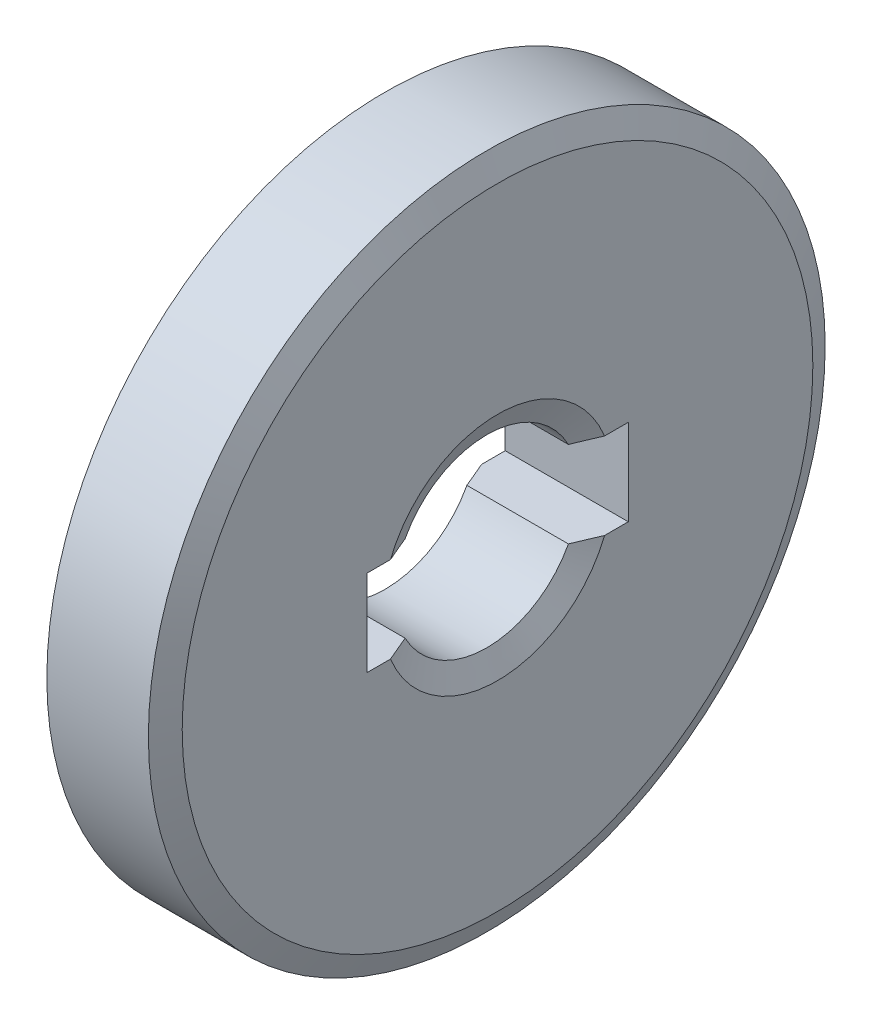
ISO-10303-21;
HEADER;
FILE_DESCRIPTION(('STEP AP214'),'2;1');
FILE_NAME('part.step','',(''),(''),'','','');
FILE_SCHEMA(('AUTOMOTIVE_DESIGN { 1 0 10303 214 1 1 1 1 }'));
ENDSEC;
DATA;
#1=APPLICATION_CONTEXT('core data for automotive mechanical design processes');
#2=APPLICATION_PROTOCOL_DEFINITION('international standard','automotive_design',2000,#1);
#3=PRODUCT_CONTEXT('',#1,'mechanical');
#4=PRODUCT('Part','Part','',(#3));
#5=PRODUCT_RELATED_PRODUCT_CATEGORY('part','',(#4));
#6=PRODUCT_DEFINITION_FORMATION('','',#4);
#7=PRODUCT_DEFINITION_CONTEXT('part definition',#1,'design');
#8=PRODUCT_DEFINITION('design','',#6,#7);
#9=PRODUCT_DEFINITION_SHAPE('','',#8);
#10=(LENGTH_UNIT() NAMED_UNIT(*) SI_UNIT(.MILLI.,.METRE.));
#11=(NAMED_UNIT(*) PLANE_ANGLE_UNIT() SI_UNIT($,.RADIAN.));
#12=(NAMED_UNIT(*) SI_UNIT($,.STERADIAN.) SOLID_ANGLE_UNIT());
#13=UNCERTAINTY_MEASURE_WITH_UNIT(LENGTH_MEASURE(1.E-05),#10,'distance_accuracy_value','');
#14=(GEOMETRIC_REPRESENTATION_CONTEXT(3) GLOBAL_UNCERTAINTY_ASSIGNED_CONTEXT((#13)) GLOBAL_UNIT_ASSIGNED_CONTEXT((#10,
#11,#12)) REPRESENTATION_CONTEXT('',''));
#15=CARTESIAN_POINT('',(0.,0.,0.));
#16=DIRECTION('',(0.,0.,1.));
#17=DIRECTION('',(1.,0.,0.));
#18=AXIS2_PLACEMENT_3D('',#15,#16,#17);
#19=CARTESIAN_POINT('',(16.2376909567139,0.,0.));
#20=DIRECTION('',(1.,0.,0.));
#21=DIRECTION('',(0.,0.,-1.));
#22=AXIS2_PLACEMENT_3D('',#19,#20,#21);
#23=CYLINDRICAL_SURFACE('',#22,3.);
#24=DIRECTION('',(1.,0.,0.));
#25=VECTOR('',#24,1.);
#26=CARTESIAN_POINT('',(16.2376909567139,1.4,2.65329983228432));
#27=LINE('',#26,#25);
#28=CARTESIAN_POINT('',(0.349730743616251,1.4,2.65329983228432));
#29=VERTEX_POINT('',#28);
#30=CARTESIAN_POINT('',(3.65026925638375,1.4,2.65329983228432));
#31=VERTEX_POINT('',#30);
#32=EDGE_CURVE('E303',#29,#31,#27,.T.);
#33=ORIENTED_EDGE('',*,*,#32,.F.);
#34=CARTESIAN_POINT('',(0.349730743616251,0.,0.));
#35=DIRECTION('',(-1.,0.,0.));
#36=DIRECTION('',(0.,0.,1.));
#37=AXIS2_PLACEMENT_3D('',#34,#35,#36);
#38=CIRCLE('',#37,3.);
#39=CARTESIAN_POINT('',(0.349730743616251,1.4,-2.65329983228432));
#40=VERTEX_POINT('',#39);
#41=EDGE_CURVE('E257',#29,#40,#38,.T.);
#42=ORIENTED_EDGE('',*,*,#41,.T.);
#43=DIRECTION('',(1.,0.,0.));
#44=VECTOR('',#43,1.);
#45=CARTESIAN_POINT('',(16.2376909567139,1.4,-2.65329983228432));
#46=LINE('',#45,#44);
#47=CARTESIAN_POINT('',(3.65026925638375,1.4,-2.65329983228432));
#48=VERTEX_POINT('',#47);
#49=EDGE_CURVE('E289',#48,#40,#46,.F.);
#50=ORIENTED_EDGE('',*,*,#49,.F.);
#51=CARTESIAN_POINT('',(3.65026925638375,0.,0.));
#52=DIRECTION('',(1.,0.,0.));
#53=DIRECTION('',(0.,0.,-1.));
#54=AXIS2_PLACEMENT_3D('',#51,#52,#53);
#55=CIRCLE('',#54,3.);
#56=EDGE_CURVE('E258',#48,#31,#55,.T.);
#57=ORIENTED_EDGE('',*,*,#56,.T.);
#58=EDGE_LOOP('',(#33,#42,#50,#57));
#59=FACE_BOUND('',#58,.T.);
#60=ADVANCED_FACE('F29',(#59),#23,.F.);
#61=CARTESIAN_POINT('',(0.,0.,0.));
#62=DIRECTION('',(-1.,0.,0.));
#63=DIRECTION('',(0.,0.,1.));
#64=AXIS2_PLACEMENT_3D('',#61,#62,#63);
#65=CONICAL_SURFACE('',#64,3.75000000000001,1.13446401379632);
#66=CARTESIAN_POINT('',(0.977240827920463,1.4,-0.881311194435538));
#67=CARTESIAN_POINT('',(0.959661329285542,1.4,-0.951983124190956));
#68=CARTESIAN_POINT('',(0.940704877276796,1.4,-1.02229247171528));
#69=CARTESIAN_POINT('',(0.900572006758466,1.4,-1.16224903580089));
#70=CARTESIAN_POINT('',(0.879396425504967,1.4,-1.23189649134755));
#71=CARTESIAN_POINT('',(0.835366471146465,1.4,-1.37057839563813));
#72=CARTESIAN_POINT('',(0.812513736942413,1.4,-1.4396133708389));
#73=CARTESIAN_POINT('',(0.765476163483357,1.4,-1.57723457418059));
#74=CARTESIAN_POINT('',(0.741291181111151,1.4,-1.64582075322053));
#75=CARTESIAN_POINT('',(0.667265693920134,1.4,-1.85080592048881));
#76=CARTESIAN_POINT('',(0.615884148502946,1.4,-1.98664686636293));
#77=CARTESIAN_POINT('',(0.510514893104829,1.4,-2.257339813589));
#78=CARTESIAN_POINT('',(0.45652655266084,1.4,-2.39219156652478));
#79=CARTESIAN_POINT('',(0.377029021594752,1.4,-2.58708791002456));
#80=CARTESIAN_POINT('',(0.352215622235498,1.4,-2.64741752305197));
#81=CARTESIAN_POINT('',(0.302290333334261,1.4,-2.76794800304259));
#82=CARTESIAN_POINT('',(0.277178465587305,1.4,-2.82814887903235));
#83=CARTESIAN_POINT('',(0.201443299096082,1.4,-3.00863906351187));
#84=CARTESIAN_POINT('',(0.150439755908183,1.4,-3.12876877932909));
#85=CARTESIAN_POINT('',(0.0381271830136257,1.4,-3.39103621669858));
#86=CARTESIAN_POINT('',(-0.023333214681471,1.4,-3.53310897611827));
#87=CARTESIAN_POINT('',(-0.147010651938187,1.4,-3.81692508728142));
#88=CARTESIAN_POINT('',(-0.209227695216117,1.4,-3.95866843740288));
#89=CARTESIAN_POINT('',(-0.396712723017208,1.4,-4.38353621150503));
#90=CARTESIAN_POINT('',(-0.5228124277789,1.4,-4.66629331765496));
#91=CARTESIAN_POINT('',(-0.77608459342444,1.4,-5.23074562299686));
#92=CARTESIAN_POINT('',(-0.903254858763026,1.4,-5.51244181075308));
#93=CARTESIAN_POINT('',(-1.1584550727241,1.4,-6.07542317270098));
#94=CARTESIAN_POINT('',(-1.28648496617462,1.4,-6.35670837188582));
#95=CARTESIAN_POINT('',(-1.41474041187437,1.4,-6.6378896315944));
#96=B_SPLINE_CURVE_WITH_KNOTS('',3,(#66,#67,#68,#69,#70,#71,#72,#73,#74,#75,#76,#77,#78,#79,#80,
#81,#82,#83,#84,#85,#86,#87,#88,#89,#90,#91,#92,#93,#94,#95),.UNSPECIFIED.,.F.,.F.,(4,2,2,2,2,2,
2,2,2,2,2,2,2,2,4),(0.,0.218434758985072,0.436787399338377,0.654929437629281,0.87309495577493,
1.30874660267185,1.74450414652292,1.94020300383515,2.13588765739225,2.52740981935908,
2.99179726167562,3.45618698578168,4.38498290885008,5.31219528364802,6.23934870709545),.UNSPECIFIED.);
#97=CARTESIAN_POINT('',(0.,1.4,-3.4788647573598));
#98=VERTEX_POINT('',#97);
#99=EDGE_CURVE('E284',#40,#98,#96,.T.);
#100=ORIENTED_EDGE('',*,*,#99,.F.);
#101=ORIENTED_EDGE('',*,*,#41,.F.);
#102=CARTESIAN_POINT('',(-0.745157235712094,1.4,5.16149676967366));
#103=CARTESIAN_POINT('',(-0.694484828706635,1.4,5.04889928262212));
#104=CARTESIAN_POINT('',(-0.643903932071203,1.4,4.93626053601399));
#105=CARTESIAN_POINT('',(-0.542971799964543,1.4,4.71087961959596));
#106=CARTESIAN_POINT('',(-0.492620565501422,1.4,4.59813744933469));
#107=CARTESIAN_POINT('',(-0.341999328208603,1.4,4.25976489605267));
#108=CARTESIAN_POINT('',(-0.242144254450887,1.4,4.03394958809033));
#109=CARTESIAN_POINT('',(-0.0444075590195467,1.4,3.58217214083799));
#110=CARTESIAN_POINT('',(0.0534786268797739,1.4,3.35621200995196));
#111=CARTESIAN_POINT('',(0.198150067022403,1.4,3.01631638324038));
#112=CARTESIAN_POINT('',(0.246020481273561,1.4,2.90284340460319));
#113=CARTESIAN_POINT('',(0.340774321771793,1.4,2.6754853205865));
#114=CARTESIAN_POINT('',(0.387657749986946,1.4,2.56160021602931));
#115=CARTESIAN_POINT('',(0.493766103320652,1.4,2.29946268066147));
#116=CARTESIAN_POINT('',(0.552532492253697,1.4,2.15102400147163));
#117=CARTESIAN_POINT('',(0.666485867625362,1.4,1.85286247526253));
#118=CARTESIAN_POINT('',(0.721675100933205,1.4,1.70314050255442));
#119=CARTESIAN_POINT('',(0.800034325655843,1.4,1.47681418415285));
#120=CARTESIAN_POINT('',(0.825444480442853,1.4,1.40098939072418));
#121=CARTESIAN_POINT('',(0.874253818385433,1.4,1.24871081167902));
#122=CARTESIAN_POINT('',(0.897653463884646,1.4,1.17225717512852));
#123=CARTESIAN_POINT('',(0.941861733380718,1.4,1.018420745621));
#124=CARTESIAN_POINT('',(0.962664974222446,1.4,0.941036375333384));
#125=CARTESIAN_POINT('',(1.00075252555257,1.4,0.785346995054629));
#126=CARTESIAN_POINT('',(1.01803397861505,1.4,0.707041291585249));
#127=CARTESIAN_POINT('',(1.03310060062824,1.4,0.628264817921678));
#128=B_SPLINE_CURVE_WITH_KNOTS('',3,(#102,#103,#104,#105,#106,#107,#108,#109,#110,#111,#112,
#113,#114,#115,#116,#117,#118,#119,#120,#121,#122,#123,#124,#125,#126,#127),.UNSPECIFIED.,.F.,
.F.,(4,2,2,2,2,2,2,2,2,2,2,2,4),(0.,0.370422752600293,0.740847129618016,1.48156792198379,
2.22030740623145,2.58977571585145,2.95924328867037,3.43816621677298,3.91678535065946,
4.15667188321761,4.39650310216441,4.63682358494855,4.87733828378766),.UNSPECIFIED.);
#129=CARTESIAN_POINT('',(0.,1.4,3.4788647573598));
#130=VERTEX_POINT('',#129);
#131=EDGE_CURVE('E298',#130,#29,#128,.T.);
#132=ORIENTED_EDGE('',*,*,#131,.F.);
#133=CARTESIAN_POINT('',(0.,0.,0.));
#134=DIRECTION('',(-1.,0.,0.));
#135=DIRECTION('',(0.,0.,1.));
#136=AXIS2_PLACEMENT_3D('',#133,#134,#135);
#137=CIRCLE('',#136,3.75000000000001);
#138=EDGE_CURVE('E277',#98,#130,#137,.F.);
#139=ORIENTED_EDGE('',*,*,#138,.F.);
#140=EDGE_LOOP('',(#100,#101,#132,#139));
#141=FACE_BOUND('',#140,.T.);
#142=ADVANCED_FACE('F227',(#141),#65,.F.);
#143=CARTESIAN_POINT('',(3.65026925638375,0.,0.));
#144=DIRECTION('',(1.,0.,0.));
#145=DIRECTION('',(0.,0.,-1.));
#146=AXIS2_PLACEMENT_3D('',#143,#144,#145);
#147=CONICAL_SURFACE('',#146,3.,1.13446401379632);
#148=CARTESIAN_POINT('',(5.41474041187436,1.4,-6.6378896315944));
#149=CARTESIAN_POINT('',(5.28628091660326,1.4,-6.35625145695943));
#150=CARTESIAN_POINT('',(5.15804209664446,1.4,-6.07451098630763));
#151=CARTESIAN_POINT('',(4.90245537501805,1.4,-5.51067901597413));
#152=CARTESIAN_POINT('',(4.77510733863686,1.4,-5.2285875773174));
#153=CARTESIAN_POINT('',(4.52187714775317,1.4,-4.66418887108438));
#154=CARTESIAN_POINT('',(4.39599329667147,1.4,-4.38188236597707));
#155=CARTESIAN_POINT('',(4.14637358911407,1.4,-3.81625565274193));
#156=CARTESIAN_POINT('',(4.02263812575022,1.4,-3.53293527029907));
#157=CARTESIAN_POINT('',(3.81809058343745,1.4,-3.05528046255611));
#158=CARTESIAN_POINT('',(3.73618746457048,1.4,-2.86141614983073));
#159=CARTESIAN_POINT('',(3.61574093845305,1.4,-2.56967263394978));
#160=CARTESIAN_POINT('',(3.57600176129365,1.4,-2.47228804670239));
#161=CARTESIAN_POINT('',(3.49758663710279,1.4,-2.27708243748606));
#162=CARTESIAN_POINT('',(3.4589107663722,1.4,-2.17926138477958));
#163=CARTESIAN_POINT('',(3.38294331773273,1.4,-1.9829192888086));
#164=CARTESIAN_POINT('',(3.3456538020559,1.4,-1.88439744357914));
#165=CARTESIAN_POINT('',(3.27308299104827,1.4,-1.68663569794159));
#166=CARTESIAN_POINT('',(3.23780129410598,1.4,-1.58739594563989));
#167=CARTESIAN_POINT('',(3.17002020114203,1.4,-1.38780461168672));
#168=CARTESIAN_POINT('',(3.1375246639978,1.4,-1.28745169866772));
#169=CARTESIAN_POINT('',(3.0918544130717,1.4,-1.13595546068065));
#170=CARTESIAN_POINT('',(3.07713866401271,1.4,-1.08527806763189));
#171=CARTESIAN_POINT('',(3.04895581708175,1.4,-0.98356765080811));
#172=CARTESIAN_POINT('',(3.03548896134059,1.4,-0.932534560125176));
#173=CARTESIAN_POINT('',(3.02275917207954,1.4,-0.881311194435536));
#174=B_SPLINE_CURVE_WITH_KNOTS('',3,(#148,#149,#150,#151,#152,#153,#154,#155,#156,#157,#158,
#159,#160,#161,#162,#163,#164,#165,#166,#167,#168,#169,#170,#171,#172,#173),.UNSPECIFIED.,.F.,
.F.,(4,2,2,2,2,2,2,2,2,2,2,2,4),(0.,0.928655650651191,1.85716768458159,2.78446761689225,
3.711935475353,4.3432819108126,4.65881913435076,4.97437894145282,5.29039076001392,
5.60633914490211,5.92271828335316,6.08101619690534,6.23934473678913),.UNSPECIFIED.);
#175=CARTESIAN_POINT('',(4.,1.4,-3.4788647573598));
#176=VERTEX_POINT('',#175);
#177=EDGE_CURVE('E11',#176,#48,#174,.T.);
#178=ORIENTED_EDGE('',*,*,#177,.F.);
#179=CARTESIAN_POINT('',(4.,0.,0.));
#180=DIRECTION('',(1.,0.,0.));
#181=DIRECTION('',(0.,0.,-1.));
#182=AXIS2_PLACEMENT_3D('',#179,#180,#181);
#183=CIRCLE('',#182,3.75000000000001);
#184=CARTESIAN_POINT('',(4.,1.4,3.4788647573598));
#185=VERTEX_POINT('',#184);
#186=EDGE_CURVE('E268',#185,#176,#183,.F.);
#187=ORIENTED_EDGE('',*,*,#186,.F.);
#188=CARTESIAN_POINT('',(2.96689939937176,1.4,0.628264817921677));
#189=CARTESIAN_POINT('',(2.97963497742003,1.4,0.694907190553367));
#190=CARTESIAN_POINT('',(2.9939693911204,1.4,0.761218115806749));
#191=CARTESIAN_POINT('',(3.02526533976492,1.4,0.893180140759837));
#192=CARTESIAN_POINT('',(3.04222534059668,1.4,0.958831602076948));
#193=CARTESIAN_POINT('',(3.07818991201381,1.4,1.08945306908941));
#194=CARTESIAN_POINT('',(3.09719124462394,1.4,1.15442397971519));
#195=CARTESIAN_POINT('',(3.13683387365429,1.4,1.28387247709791));
#196=CARTESIAN_POINT('',(3.15747544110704,1.4,1.3483499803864));
#197=CARTESIAN_POINT('',(3.22121269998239,1.4,1.54081880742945));
#198=CARTESIAN_POINT('',(3.26621576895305,1.4,1.66817618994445));
#199=CARTESIAN_POINT('',(3.35945391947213,1.4,1.92173100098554));
#200=CARTESIAN_POINT('',(3.40769008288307,1.4,2.04792802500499));
#201=CARTESIAN_POINT('',(3.47492512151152,1.4,2.2194230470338));
#202=CARTESIAN_POINT('',(3.49299227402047,1.4,2.26508869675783));
#203=CARTESIAN_POINT('',(3.52938121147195,1.4,2.35633125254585));
#204=CARTESIAN_POINT('',(3.54770305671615,1.4,2.40190813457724));
#205=CARTESIAN_POINT('',(3.6124432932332,1.4,2.56185706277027));
#206=CARTESIAN_POINT('',(3.65943546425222,1.4,2.67599692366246));
#207=CARTESIAN_POINT('',(3.75440868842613,1.4,2.90386493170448));
#208=CARTESIAN_POINT('',(3.80238975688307,1.4,3.01759307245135));
#209=CARTESIAN_POINT('',(3.94742913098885,1.4,3.35832745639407));
#210=CARTESIAN_POINT('',(4.04557764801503,1.4,3.58486915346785));
#211=CARTESIAN_POINT('',(4.2433659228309,1.4,4.03671718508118));
#212=CARTESIAN_POINT('',(4.34300202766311,1.4,4.26202512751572));
#213=CARTESIAN_POINT('',(4.49327272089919,1.4,4.59959868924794));
#214=CARTESIAN_POINT('',(4.54349444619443,1.4,4.71204829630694));
#215=CARTESIAN_POINT('',(4.64416618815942,1.4,4.93684453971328));
#216=CARTESIAN_POINT('',(4.69461620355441,1.4,5.04919117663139));
#217=CARTESIAN_POINT('',(4.74515723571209,1.4,5.16149676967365));
#218=B_SPLINE_CURVE_WITH_KNOTS('',3,(#188,#189,#190,#191,#192,#193,#194,#195,#196,#197,#198,
#199,#200,#201,#202,#203,#204,#205,#206,#207,#208,#209,#210,#211,#212,#213,#214,#215,#216,#217),
.UNSPECIFIED.,.F.,.F.,(4,2,2,2,2,2,2,2,2,2,2,2,2,2,4),(0.,0.203488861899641,0.406859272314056,
0.609911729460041,0.81299780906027,1.21814153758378,1.62342151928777,1.77075047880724,
1.91811493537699,2.28841214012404,2.65871507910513,3.39936800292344,4.1384311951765,
4.50789573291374,4.87735821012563),.UNSPECIFIED.);
#219=EDGE_CURVE('E42',#31,#185,#218,.T.);
#220=ORIENTED_EDGE('',*,*,#219,.F.);
#221=ORIENTED_EDGE('',*,*,#56,.F.);
#222=EDGE_LOOP('',(#178,#187,#220,#221));
#223=FACE_BOUND('',#222,.T.);
#224=ADVANCED_FACE('F214',(#223),#147,.F.);
#225=CARTESIAN_POINT('',(0.,11.,0.));
#226=DIRECTION('',(-1.,0.,0.));
#227=DIRECTION('',(0.,0.,1.));
#228=AXIS2_PLACEMENT_3D('',#225,#226,#227);
#229=PLANE('',#228);
#230=DIRECTION('',(0.,0.,1.));
#231=VECTOR('',#230,1.);
#232=CARTESIAN_POINT('',(0.,1.4,4.25));
#233=LINE('',#232,#231);
#234=CARTESIAN_POINT('',(0.,1.4,-4.25));
#235=VERTEX_POINT('',#234);
#236=EDGE_CURVE('E129',#235,#98,#233,.T.);
#237=ORIENTED_EDGE('',*,*,#236,.T.);
#238=ORIENTED_EDGE('',*,*,#138,.T.);
#239=CARTESIAN_POINT('',(0.,1.4,4.25));
#240=VERTEX_POINT('',#239);
#241=EDGE_CURVE('E161',#130,#240,#233,.T.);
#242=ORIENTED_EDGE('',*,*,#241,.T.);
#243=DIRECTION('',(0.,-1.,0.));
#244=VECTOR('',#243,1.);
#245=CARTESIAN_POINT('',(0.,-1.4,4.25));
#246=LINE('',#245,#244);
#247=CARTESIAN_POINT('',(0.,-1.4,4.25));
#248=VERTEX_POINT('',#247);
#249=EDGE_CURVE('E154',#240,#248,#246,.T.);
#250=ORIENTED_EDGE('',*,*,#249,.T.);
#251=DIRECTION('',(0.,0.,-1.));
#252=VECTOR('',#251,1.);
#253=CARTESIAN_POINT('',(0.,-1.4,4.25));
#254=LINE('',#253,#252);
#255=CARTESIAN_POINT('',(0.,-1.4,3.4788647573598));
#256=VERTEX_POINT('',#255);
#257=EDGE_CURVE('E124',#248,#256,#254,.T.);
#258=ORIENTED_EDGE('',*,*,#257,.T.);
#259=CARTESIAN_POINT('',(0.,-1.4,-3.4788647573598));
#260=VERTEX_POINT('',#259);
#261=EDGE_CURVE('E276',#256,#260,#137,.F.);
#262=ORIENTED_EDGE('',*,*,#261,.T.);
#263=CARTESIAN_POINT('',(0.,-1.4,-4.25));
#264=VERTEX_POINT('',#263);
#265=EDGE_CURVE('E156',#260,#264,#254,.T.);
#266=ORIENTED_EDGE('',*,*,#265,.T.);
#267=DIRECTION('',(0.,1.,0.));
#268=VECTOR('',#267,1.);
#269=CARTESIAN_POINT('',(0.,-1.4,-4.25));
#270=LINE('',#269,#268);
#271=EDGE_CURVE('E158',#264,#235,#270,.T.);
#272=ORIENTED_EDGE('',*,*,#271,.T.);
#273=EDGE_LOOP('',(#237,#238,#242,#250,#258,#262,#266,#272));
#274=FACE_BOUND('',#273,.T.);
#275=CARTESIAN_POINT('',(0.,0.,0.));
#276=DIRECTION('',(-1.,0.,0.));
#277=DIRECTION('',(0.,0.,1.));
#278=AXIS2_PLACEMENT_3D('',#275,#276,#277);
#279=CIRCLE('',#278,10.25);
#280=CARTESIAN_POINT('',(0.,0.,10.25));
#281=VERTEX_POINT('',#280);
#282=EDGE_CURVE('E280',#281,#281,#279,.T.);
#283=ORIENTED_EDGE('',*,*,#282,.T.);
#284=EDGE_LOOP('',(#283));
#285=FACE_BOUND('',#284,.T.);
#286=ADVANCED_FACE('F31',(#274,#285),#229,.T.);
#287=DIRECTION('',(1.,0.,0.));
#288=VECTOR('',#287,1.);
#289=CARTESIAN_POINT('',(16.2376909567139,-1.4,-2.65329983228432));
#290=LINE('',#289,#288);
#291=CARTESIAN_POINT('',(0.349730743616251,-1.4,-2.65329983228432));
#292=VERTEX_POINT('',#291);
#293=CARTESIAN_POINT('',(3.65026925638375,-1.4,-2.65329983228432));
#294=VERTEX_POINT('',#293);
#295=EDGE_CURVE('E49',#292,#294,#290,.T.);
#296=ORIENTED_EDGE('',*,*,#295,.F.);
#297=CARTESIAN_POINT('',(0.349730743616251,-1.4,2.65329983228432));
#298=VERTEX_POINT('',#297);
#299=EDGE_CURVE('E248',#292,#298,#38,.T.);
#300=ORIENTED_EDGE('',*,*,#299,.T.);
#301=DIRECTION('',(1.,0.,0.));
#302=VECTOR('',#301,1.);
#303=CARTESIAN_POINT('',(16.2376909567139,-1.4,2.65329983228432));
#304=LINE('',#303,#302);
#305=CARTESIAN_POINT('',(3.65026925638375,-1.4,2.65329983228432));
#306=VERTEX_POINT('',#305);
#307=EDGE_CURVE('E165',#306,#298,#304,.F.);
#308=ORIENTED_EDGE('',*,*,#307,.F.);
#309=EDGE_CURVE('E250',#306,#294,#55,.T.);
#310=ORIENTED_EDGE('',*,*,#309,.T.);
#311=EDGE_LOOP('',(#296,#300,#308,#310));
#312=FACE_BOUND('',#311,.T.);
#313=ADVANCED_FACE('F229',(#312),#23,.F.);
#314=CARTESIAN_POINT('',(4.,11.,0.));
#315=DIRECTION('',(1.,0.,0.));
#316=DIRECTION('',(0.,0.,-1.));
#317=AXIS2_PLACEMENT_3D('',#314,#315,#316);
#318=PLANE('',#317);
#319=DIRECTION('',(0.,0.,1.));
#320=VECTOR('',#319,1.);
#321=CARTESIAN_POINT('',(4.,1.4,4.25));
#322=LINE('',#321,#320);
#323=CARTESIAN_POINT('',(4.,1.4,4.25));
#324=VERTEX_POINT('',#323);
#325=EDGE_CURVE('E149',#185,#324,#322,.T.);
#326=ORIENTED_EDGE('',*,*,#325,.F.);
#327=ORIENTED_EDGE('',*,*,#186,.T.);
#328=CARTESIAN_POINT('',(4.,1.4,-4.25));
#329=VERTEX_POINT('',#328);
#330=EDGE_CURVE('E152',#329,#176,#322,.T.);
#331=ORIENTED_EDGE('',*,*,#330,.F.);
#332=DIRECTION('',(0.,1.,0.));
#333=VECTOR('',#332,1.);
#334=CARTESIAN_POINT('',(4.,-1.4,-4.25));
#335=LINE('',#334,#333);
#336=CARTESIAN_POINT('',(4.,-1.4,-4.25));
#337=VERTEX_POINT('',#336);
#338=EDGE_CURVE('E146',#337,#329,#335,.T.);
#339=ORIENTED_EDGE('',*,*,#338,.F.);
#340=DIRECTION('',(0.,0.,-1.));
#341=VECTOR('',#340,1.);
#342=CARTESIAN_POINT('',(4.,-1.4,4.25));
#343=LINE('',#342,#341);
#344=CARTESIAN_POINT('',(4.,-1.4,-3.4788647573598));
#345=VERTEX_POINT('',#344);
#346=EDGE_CURVE('E138',#345,#337,#343,.T.);
#347=ORIENTED_EDGE('',*,*,#346,.F.);
#348=CARTESIAN_POINT('',(4.,-1.4,3.4788647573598));
#349=VERTEX_POINT('',#348);
#350=EDGE_CURVE('E145',#345,#349,#183,.F.);
#351=ORIENTED_EDGE('',*,*,#350,.T.);
#352=CARTESIAN_POINT('',(4.,-1.4,4.25));
#353=VERTEX_POINT('',#352);
#354=EDGE_CURVE('E57',#353,#349,#343,.T.);
#355=ORIENTED_EDGE('',*,*,#354,.F.);
#356=DIRECTION('',(0.,-1.,0.));
#357=VECTOR('',#356,1.);
#358=CARTESIAN_POINT('',(4.,-1.4,4.25));
#359=LINE('',#358,#357);
#360=EDGE_CURVE('E133',#324,#353,#359,.T.);
#361=ORIENTED_EDGE('',*,*,#360,.F.);
#362=EDGE_LOOP('',(#326,#327,#331,#339,#347,#351,#355,#361));
#363=FACE_BOUND('',#362,.T.);
#364=CARTESIAN_POINT('',(4.,0.,0.));
#365=DIRECTION('',(1.,0.,0.));
#366=DIRECTION('',(0.,0.,-1.));
#367=AXIS2_PLACEMENT_3D('',#364,#365,#366);
#368=CIRCLE('',#367,10.25);
#369=CARTESIAN_POINT('',(4.,0.,-10.25));
#370=VERTEX_POINT('',#369);
#371=EDGE_CURVE('E261',#370,#370,#368,.T.);
#372=ORIENTED_EDGE('',*,*,#371,.T.);
#373=EDGE_LOOP('',(#372));
#374=FACE_BOUND('',#373,.T.);
#375=ADVANCED_FACE('F141',(#363,#374),#318,.T.);
#376=CARTESIAN_POINT('',(16.2376909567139,0.,0.));
#377=DIRECTION('',(1.,0.,0.));
#378=DIRECTION('',(0.,0.,-1.));
#379=AXIS2_PLACEMENT_3D('',#376,#377,#378);
#380=CYLINDRICAL_SURFACE('',#379,11.);
#381=CARTESIAN_POINT('',(3.65026925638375,0.,0.));
#382=DIRECTION('',(1.,0.,0.));
#383=DIRECTION('',(0.,0.,-1.));
#384=AXIS2_PLACEMENT_3D('',#381,#382,#383);
#385=CIRCLE('',#384,11.);
#386=CARTESIAN_POINT('',(3.65026925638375,0.,-11.));
#387=VERTEX_POINT('',#386);
#388=EDGE_CURVE('E272',#387,#387,#385,.F.);
#389=ORIENTED_EDGE('',*,*,#388,.T.);
#390=EDGE_LOOP('',(#389));
#391=FACE_BOUND('',#390,.T.);
#392=CARTESIAN_POINT('',(0.349730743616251,0.,0.));
#393=DIRECTION('',(-1.,0.,0.));
#394=DIRECTION('',(0.,0.,1.));
#395=AXIS2_PLACEMENT_3D('',#392,#393,#394);
#396=CIRCLE('',#395,11.);
#397=CARTESIAN_POINT('',(0.349730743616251,0.,11.));
#398=VERTEX_POINT('',#397);
#399=EDGE_CURVE('E270',#398,#398,#396,.F.);
#400=ORIENTED_EDGE('',*,*,#399,.T.);
#401=EDGE_LOOP('',(#400));
#402=FACE_BOUND('',#401,.T.);
#403=ADVANCED_FACE('F242',(#391,#402),#380,.T.);
#404=CARTESIAN_POINT('',(-1.41474041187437,-1.4,-6.6378896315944));
#405=CARTESIAN_POINT('',(-1.28628091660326,-1.4,-6.35625145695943));
#406=CARTESIAN_POINT('',(-1.15804209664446,-1.4,-6.07451098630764));
#407=CARTESIAN_POINT('',(-0.902455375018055,-1.4,-5.51067901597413));
#408=CARTESIAN_POINT('',(-0.775107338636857,-1.4,-5.2285875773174));
#409=CARTESIAN_POINT('',(-0.521877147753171,-1.4,-4.66418887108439));
#410=CARTESIAN_POINT('',(-0.395993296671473,-1.4,-4.38188236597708));
#411=CARTESIAN_POINT('',(-0.146373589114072,-1.4,-3.81625565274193));
#412=CARTESIAN_POINT('',(-0.0226381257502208,-1.4,-3.53293527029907));
#413=CARTESIAN_POINT('',(0.181909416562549,-1.4,-3.05528046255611));
#414=CARTESIAN_POINT('',(0.263812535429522,-1.4,-2.86141614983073));
#415=CARTESIAN_POINT('',(0.384259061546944,-1.4,-2.56967263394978));
#416=CARTESIAN_POINT('',(0.423998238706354,-1.4,-2.47228804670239));
#417=CARTESIAN_POINT('',(0.502413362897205,-1.4,-2.27708243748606));
#418=CARTESIAN_POINT('',(0.541089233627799,-1.4,-2.17926138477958));
#419=CARTESIAN_POINT('',(0.617056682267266,-1.4,-1.9829192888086));
#420=CARTESIAN_POINT('',(0.654346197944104,-1.4,-1.88439744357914));
#421=CARTESIAN_POINT('',(0.726917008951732,-1.4,-1.68663569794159));
#422=CARTESIAN_POINT('',(0.762198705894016,-1.4,-1.5873959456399));
#423=CARTESIAN_POINT('',(0.829979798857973,-1.4,-1.38780461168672));
#424=CARTESIAN_POINT('',(0.862475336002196,-1.4,-1.28745169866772));
#425=CARTESIAN_POINT('',(0.908145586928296,-1.4,-1.13595546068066));
#426=CARTESIAN_POINT('',(0.922861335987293,-1.4,-1.08527806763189));
#427=CARTESIAN_POINT('',(0.951044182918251,-1.4,-0.983567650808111));
#428=CARTESIAN_POINT('',(0.964511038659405,-1.4,-0.932534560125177));
#429=CARTESIAN_POINT('',(0.977240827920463,-1.4,-0.881311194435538));
#430=B_SPLINE_CURVE_WITH_KNOTS('',3,(#404,#405,#406,#407,#408,#409,#410,#411,#412,#413,#414,
#415,#416,#417,#418,#419,#420,#421,#422,#423,#424,#425,#426,#427,#428,#429),.UNSPECIFIED.,.F.,
.F.,(4,2,2,2,2,2,2,2,2,2,2,2,4),(0.,0.928655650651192,1.85716768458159,2.78446761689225,
3.71193547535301,4.3432819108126,4.65881913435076,4.97437894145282,5.29039076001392,
5.60633914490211,5.92271828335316,6.08101619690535,6.23934473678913),.UNSPECIFIED.);
#431=EDGE_CURVE('E251',#260,#292,#430,.T.);
#432=ORIENTED_EDGE('',*,*,#431,.F.);
#433=ORIENTED_EDGE('',*,*,#261,.F.);
#434=CARTESIAN_POINT('',(1.03310060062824,-1.4,0.628264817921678));
#435=CARTESIAN_POINT('',(1.02036502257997,-1.4,0.694907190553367));
#436=CARTESIAN_POINT('',(1.0060306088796,-1.4,0.761218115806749));
#437=CARTESIAN_POINT('',(0.97473466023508,-1.4,0.893180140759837));
#438=CARTESIAN_POINT('',(0.957774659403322,-1.4,0.958831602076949));
#439=CARTESIAN_POINT('',(0.921810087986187,-1.4,1.08945306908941));
#440=CARTESIAN_POINT('',(0.902808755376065,-1.4,1.15442397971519));
#441=CARTESIAN_POINT('',(0.863166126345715,-1.4,1.28387247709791));
#442=CARTESIAN_POINT('',(0.84252455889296,-1.4,1.34834998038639));
#443=CARTESIAN_POINT('',(0.778787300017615,-1.4,1.54081880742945));
#444=CARTESIAN_POINT('',(0.733784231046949,-1.4,1.66817618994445));
#445=CARTESIAN_POINT('',(0.640546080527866,-1.4,1.92173100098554));
#446=CARTESIAN_POINT('',(0.592309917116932,-1.4,2.04792802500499));
#447=CARTESIAN_POINT('',(0.525074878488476,-1.4,2.2194230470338));
#448=CARTESIAN_POINT('',(0.507007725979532,-1.4,2.26508869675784));
#449=CARTESIAN_POINT('',(0.470618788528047,-1.4,2.35633125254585));
#450=CARTESIAN_POINT('',(0.452296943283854,-1.4,2.40190813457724));
#451=CARTESIAN_POINT('',(0.387556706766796,-1.4,2.56185706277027));
#452=CARTESIAN_POINT('',(0.340564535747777,-1.4,2.67599692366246));
#453=CARTESIAN_POINT('',(0.245591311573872,-1.4,2.90386493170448));
#454=CARTESIAN_POINT('',(0.197610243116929,-1.4,3.01759307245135));
#455=CARTESIAN_POINT('',(0.0525708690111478,-1.4,3.35832745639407));
#456=CARTESIAN_POINT('',(-0.0455776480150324,-1.4,3.58486915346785));
#457=CARTESIAN_POINT('',(-0.243365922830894,-1.4,4.03671718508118));
#458=CARTESIAN_POINT('',(-0.343002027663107,-1.4,4.26202512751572));
#459=CARTESIAN_POINT('',(-0.493272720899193,-1.4,4.59959868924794));
#460=CARTESIAN_POINT('',(-0.543494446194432,-1.4,4.71204829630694));
#461=CARTESIAN_POINT('',(-0.644166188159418,-1.4,4.93684453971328));
#462=CARTESIAN_POINT('',(-0.694616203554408,-1.4,5.04919117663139));
#463=CARTESIAN_POINT('',(-0.745157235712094,-1.4,5.16149676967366));
#464=B_SPLINE_CURVE_WITH_KNOTS('',3,(#434,#435,#436,#437,#438,#439,#440,#441,#442,#443,#444,
#445,#446,#447,#448,#449,#450,#451,#452,#453,#454,#455,#456,#457,#458,#459,#460,#461,#462,#463),
.UNSPECIFIED.,.F.,.F.,(4,2,2,2,2,2,2,2,2,2,2,2,2,2,4),(0.,0.20348886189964,0.406859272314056,
0.60991172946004,0.812997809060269,1.21814153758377,1.62342151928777,1.77075047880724,
1.91811493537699,2.28841214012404,2.65871507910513,3.39936800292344,4.1384311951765,
4.50789573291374,4.87735821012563),.UNSPECIFIED.);
#465=EDGE_CURVE('E171',#298,#256,#464,.T.);
#466=ORIENTED_EDGE('',*,*,#465,.F.);
#467=ORIENTED_EDGE('',*,*,#299,.F.);
#468=EDGE_LOOP('',(#432,#433,#466,#467));
#469=FACE_BOUND('',#468,.T.);
#470=ADVANCED_FACE('F179',(#469),#65,.F.);
#471=CARTESIAN_POINT('',(3.02275917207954,-1.4,-0.881311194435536));
#472=CARTESIAN_POINT('',(3.04033867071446,-1.4,-0.951983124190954));
#473=CARTESIAN_POINT('',(3.0592951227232,-1.4,-1.02229247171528));
#474=CARTESIAN_POINT('',(3.09942799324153,-1.4,-1.16224903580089));
#475=CARTESIAN_POINT('',(3.12060357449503,-1.4,-1.23189649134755));
#476=CARTESIAN_POINT('',(3.16463352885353,-1.4,-1.37057839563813));
#477=CARTESIAN_POINT('',(3.18748626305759,-1.4,-1.4396133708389));
#478=CARTESIAN_POINT('',(3.23452383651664,-1.4,-1.57723457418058));
#479=CARTESIAN_POINT('',(3.25870881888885,-1.4,-1.64582075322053));
#480=CARTESIAN_POINT('',(3.33273430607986,-1.4,-1.85080592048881));
#481=CARTESIAN_POINT('',(3.38411585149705,-1.4,-1.98664686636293));
#482=CARTESIAN_POINT('',(3.48948510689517,-1.4,-2.25733981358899));
#483=CARTESIAN_POINT('',(3.54347344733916,-1.4,-2.39219156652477));
#484=CARTESIAN_POINT('',(3.62297097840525,-1.4,-2.58708791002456));
#485=CARTESIAN_POINT('',(3.6477843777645,-1.4,-2.64741752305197));
#486=CARTESIAN_POINT('',(3.69770966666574,-1.4,-2.76794800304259));
#487=CARTESIAN_POINT('',(3.72282153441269,-1.4,-2.82814887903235));
#488=CARTESIAN_POINT('',(3.79855670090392,-1.4,-3.00863906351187));
#489=CARTESIAN_POINT('',(3.84956024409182,-1.4,-3.12876877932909));
#490=CARTESIAN_POINT('',(3.96187281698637,-1.4,-3.39103621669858));
#491=CARTESIAN_POINT('',(4.02333321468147,-1.4,-3.53310897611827));
#492=CARTESIAN_POINT('',(4.14701065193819,-1.4,-3.81692508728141));
#493=CARTESIAN_POINT('',(4.20922769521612,-1.4,-3.95866843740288));
#494=CARTESIAN_POINT('',(4.39671272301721,-1.4,-4.38353621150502));
#495=CARTESIAN_POINT('',(4.5228124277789,-1.4,-4.66629331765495));
#496=CARTESIAN_POINT('',(4.77608459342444,-1.4,-5.23074562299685));
#497=CARTESIAN_POINT('',(4.90325485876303,-1.4,-5.51244181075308));
#498=CARTESIAN_POINT('',(5.1584550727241,-1.4,-6.07542317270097));
#499=CARTESIAN_POINT('',(5.28648496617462,-1.4,-6.35670837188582));
#500=CARTESIAN_POINT('',(5.41474041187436,-1.4,-6.6378896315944));
#501=B_SPLINE_CURVE_WITH_KNOTS('',3,(#471,#472,#473,#474,#475,#476,#477,#478,#479,#480,#481,
#482,#483,#484,#485,#486,#487,#488,#489,#490,#491,#492,#493,#494,#495,#496,#497,#498,#499,#500),
.UNSPECIFIED.,.F.,.F.,(4,2,2,2,2,2,2,2,2,2,2,2,2,2,4),(0.,0.218434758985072,0.436787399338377,
0.65492943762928,0.873094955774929,1.30874660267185,1.74450414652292,1.94020300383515,
2.13588765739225,2.52740981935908,2.99179726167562,3.45618698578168,4.38498290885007,
5.31219528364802,6.23934870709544),.UNSPECIFIED.);
#502=EDGE_CURVE('E201',#294,#345,#501,.T.);
#503=ORIENTED_EDGE('',*,*,#502,.F.);
#504=ORIENTED_EDGE('',*,*,#309,.F.);
#505=CARTESIAN_POINT('',(4.74515723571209,-1.4,5.16149676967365));
#506=CARTESIAN_POINT('',(4.69448482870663,-1.4,5.04889928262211));
#507=CARTESIAN_POINT('',(4.6439039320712,-1.4,4.93626053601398));
#508=CARTESIAN_POINT('',(4.54297179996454,-1.4,4.71087961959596));
#509=CARTESIAN_POINT('',(4.49262056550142,-1.4,4.59813744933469));
#510=CARTESIAN_POINT('',(4.3419993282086,-1.4,4.25976489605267));
#511=CARTESIAN_POINT('',(4.24214425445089,-1.4,4.03394958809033));
#512=CARTESIAN_POINT('',(4.04440755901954,-1.4,3.58217214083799));
#513=CARTESIAN_POINT('',(3.94652137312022,-1.4,3.35621200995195));
#514=CARTESIAN_POINT('',(3.8018499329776,-1.4,3.01631638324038));
#515=CARTESIAN_POINT('',(3.75397951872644,-1.4,2.90284340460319));
#516=CARTESIAN_POINT('',(3.65922567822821,-1.4,2.67548532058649));
#517=CARTESIAN_POINT('',(3.61234225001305,-1.4,2.5616002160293));
#518=CARTESIAN_POINT('',(3.50623389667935,-1.4,2.29946268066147));
#519=CARTESIAN_POINT('',(3.4474675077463,-1.4,2.15102400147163));
#520=CARTESIAN_POINT('',(3.33351413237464,-1.4,1.85286247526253));
#521=CARTESIAN_POINT('',(3.27832489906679,-1.4,1.70314050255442));
#522=CARTESIAN_POINT('',(3.19996567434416,-1.4,1.47681418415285));
#523=CARTESIAN_POINT('',(3.17455551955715,-1.4,1.40098939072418));
#524=CARTESIAN_POINT('',(3.12574618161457,-1.4,1.24871081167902));
#525=CARTESIAN_POINT('',(3.10234653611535,-1.4,1.17225717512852));
#526=CARTESIAN_POINT('',(3.05813826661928,-1.4,1.018420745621));
#527=CARTESIAN_POINT('',(3.03733502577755,-1.4,0.941036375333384));
#528=CARTESIAN_POINT('',(2.99924747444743,-1.4,0.785346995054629));
#529=CARTESIAN_POINT('',(2.98196602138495,-1.4,0.707041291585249));
#530=CARTESIAN_POINT('',(2.96689939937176,-1.4,0.628264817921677));
#531=B_SPLINE_CURVE_WITH_KNOTS('',3,(#505,#506,#507,#508,#509,#510,#511,#512,#513,#514,#515,
#516,#517,#518,#519,#520,#521,#522,#523,#524,#525,#526,#527,#528,#529,#530),.UNSPECIFIED.,.F.,
.F.,(4,2,2,2,2,2,2,2,2,2,2,2,4),(0.,0.370422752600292,0.740847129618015,1.48156792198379,
2.22030740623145,2.58977571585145,2.95924328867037,3.43816621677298,3.91678535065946,
4.15667188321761,4.39650310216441,4.63682358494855,4.87733828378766),.UNSPECIFIED.);
#532=EDGE_CURVE('E194',#349,#306,#531,.T.);
#533=ORIENTED_EDGE('',*,*,#532,.F.);
#534=ORIENTED_EDGE('',*,*,#350,.F.);
#535=EDGE_LOOP('',(#503,#504,#533,#534));
#536=FACE_BOUND('',#535,.T.);
#537=ADVANCED_FACE('F208',(#536),#147,.F.);
#538=CARTESIAN_POINT('',(4.,0.,0.));
#539=DIRECTION('',(-1.,0.,0.));
#540=DIRECTION('',(0.,0.,1.));
#541=AXIS2_PLACEMENT_3D('',#538,#539,#540);
#542=CONICAL_SURFACE('',#541,10.25,1.13446401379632);
#543=ORIENTED_EDGE('',*,*,#388,.F.);
#544=EDGE_LOOP('',(#543));
#545=FACE_BOUND('',#544,.T.);
#546=ORIENTED_EDGE('',*,*,#371,.F.);
#547=EDGE_LOOP('',(#546));
#548=FACE_BOUND('',#547,.T.);
#549=ADVANCED_FACE('F212',(#545,#548),#542,.T.);
#550=CARTESIAN_POINT('',(0.349730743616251,0.,0.));
#551=DIRECTION('',(1.,0.,0.));
#552=DIRECTION('',(0.,0.,-1.));
#553=AXIS2_PLACEMENT_3D('',#550,#551,#552);
#554=CONICAL_SURFACE('',#553,11.,1.13446401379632);
#555=ORIENTED_EDGE('',*,*,#282,.F.);
#556=EDGE_LOOP('',(#555));
#557=FACE_BOUND('',#556,.T.);
#558=ORIENTED_EDGE('',*,*,#399,.F.);
#559=EDGE_LOOP('',(#558));
#560=FACE_BOUND('',#559,.T.);
#561=ADVANCED_FACE('F187',(#557,#560),#554,.T.);
#562=CARTESIAN_POINT('',(0.,-1.4,4.25));
#563=DIRECTION('',(0.,-1.,0.));
#564=DIRECTION('',(0.,0.,-1.));
#565=AXIS2_PLACEMENT_3D('',#562,#563,#564);
#566=PLANE('',#565);
#567=ORIENTED_EDGE('',*,*,#465,.T.);
#568=ORIENTED_EDGE('',*,*,#257,.F.);
#569=DIRECTION('',(1.,0.,0.));
#570=VECTOR('',#569,1.);
#571=CARTESIAN_POINT('',(0.,-1.4,4.25));
#572=LINE('',#571,#570);
#573=EDGE_CURVE('E120',#248,#353,#572,.T.);
#574=ORIENTED_EDGE('',*,*,#573,.T.);
#575=ORIENTED_EDGE('',*,*,#354,.T.);
#576=ORIENTED_EDGE('',*,*,#532,.T.);
#577=ORIENTED_EDGE('',*,*,#307,.T.);
#578=EDGE_LOOP('',(#567,#568,#574,#575,#576,#577));
#579=FACE_BOUND('',#578,.T.);
#580=ADVANCED_FACE('F122',(#579),#566,.F.);
#581=CARTESIAN_POINT('',(0.,1.4,4.25));
#582=DIRECTION('',(0.,1.,0.));
#583=DIRECTION('',(0.,0.,1.));
#584=AXIS2_PLACEMENT_3D('',#581,#582,#583);
#585=PLANE('',#584);
#586=ORIENTED_EDGE('',*,*,#131,.T.);
#587=ORIENTED_EDGE('',*,*,#32,.T.);
#588=ORIENTED_EDGE('',*,*,#219,.T.);
#589=ORIENTED_EDGE('',*,*,#325,.T.);
#590=DIRECTION('',(1.,0.,0.));
#591=VECTOR('',#590,1.);
#592=CARTESIAN_POINT('',(0.,1.4,4.25));
#593=LINE('',#592,#591);
#594=EDGE_CURVE('E135',#240,#324,#593,.T.);
#595=ORIENTED_EDGE('',*,*,#594,.F.);
#596=ORIENTED_EDGE('',*,*,#241,.F.);
#597=EDGE_LOOP('',(#586,#587,#588,#589,#595,#596));
#598=FACE_BOUND('',#597,.T.);
#599=ADVANCED_FACE('F186',(#598),#585,.F.);
#600=CARTESIAN_POINT('',(0.,-1.4,4.25));
#601=DIRECTION('',(0.,0.,1.));
#602=DIRECTION('',(1.,0.,0.));
#603=AXIS2_PLACEMENT_3D('',#600,#601,#602);
#604=PLANE('',#603);
#605=ORIENTED_EDGE('',*,*,#360,.T.);
#606=ORIENTED_EDGE('',*,*,#573,.F.);
#607=ORIENTED_EDGE('',*,*,#249,.F.);
#608=ORIENTED_EDGE('',*,*,#594,.T.);
#609=EDGE_LOOP('',(#605,#606,#607,#608));
#610=FACE_BOUND('',#609,.T.);
#611=ADVANCED_FACE('F134',(#610),#604,.F.);
#612=ORIENTED_EDGE('',*,*,#99,.T.);
#613=ORIENTED_EDGE('',*,*,#236,.F.);
#614=DIRECTION('',(1.,0.,0.));
#615=VECTOR('',#614,1.);
#616=CARTESIAN_POINT('',(0.,1.4,-4.25));
#617=LINE('',#616,#615);
#618=EDGE_CURVE('E166',#235,#329,#617,.T.);
#619=ORIENTED_EDGE('',*,*,#618,.T.);
#620=ORIENTED_EDGE('',*,*,#330,.T.);
#621=ORIENTED_EDGE('',*,*,#177,.T.);
#622=ORIENTED_EDGE('',*,*,#49,.T.);
#623=EDGE_LOOP('',(#612,#613,#619,#620,#621,#622));
#624=FACE_BOUND('',#623,.T.);
#625=ADVANCED_FACE('F294',(#624),#585,.F.);
#626=ORIENTED_EDGE('',*,*,#431,.T.);
#627=ORIENTED_EDGE('',*,*,#295,.T.);
#628=ORIENTED_EDGE('',*,*,#502,.T.);
#629=ORIENTED_EDGE('',*,*,#346,.T.);
#630=DIRECTION('',(1.,0.,0.));
#631=VECTOR('',#630,1.);
#632=CARTESIAN_POINT('',(0.,-1.4,-4.25));
#633=LINE('',#632,#631);
#634=EDGE_CURVE('E128',#264,#337,#633,.T.);
#635=ORIENTED_EDGE('',*,*,#634,.F.);
#636=ORIENTED_EDGE('',*,*,#265,.F.);
#637=EDGE_LOOP('',(#626,#627,#628,#629,#635,#636));
#638=FACE_BOUND('',#637,.T.);
#639=ADVANCED_FACE('F188',(#638),#566,.F.);
#640=CARTESIAN_POINT('',(0.,-1.4,-4.25));
#641=DIRECTION('',(0.,0.,-1.));
#642=DIRECTION('',(-1.,0.,0.));
#643=AXIS2_PLACEMENT_3D('',#640,#641,#642);
#644=PLANE('',#643);
#645=ORIENTED_EDGE('',*,*,#338,.T.);
#646=ORIENTED_EDGE('',*,*,#618,.F.);
#647=ORIENTED_EDGE('',*,*,#271,.F.);
#648=ORIENTED_EDGE('',*,*,#634,.T.);
#649=EDGE_LOOP('',(#645,#646,#647,#648));
#650=FACE_BOUND('',#649,.T.);
#651=ADVANCED_FACE('F189',(#650),#644,.F.);
#652=CLOSED_SHELL('',(#60,#142,#224,#286,#313,#375,#403,#470,#537,#549,#561,#580,#599,#611,#625,
#639,#651));
#653=MANIFOLD_SOLID_BREP('B2',#652);
#654=ADVANCED_BREP_SHAPE_REPRESENTATION('',(#18,#653),#14);
#655=SHAPE_DEFINITION_REPRESENTATION(#9,#654);
ENDSEC;
END-ISO-10303-21;
